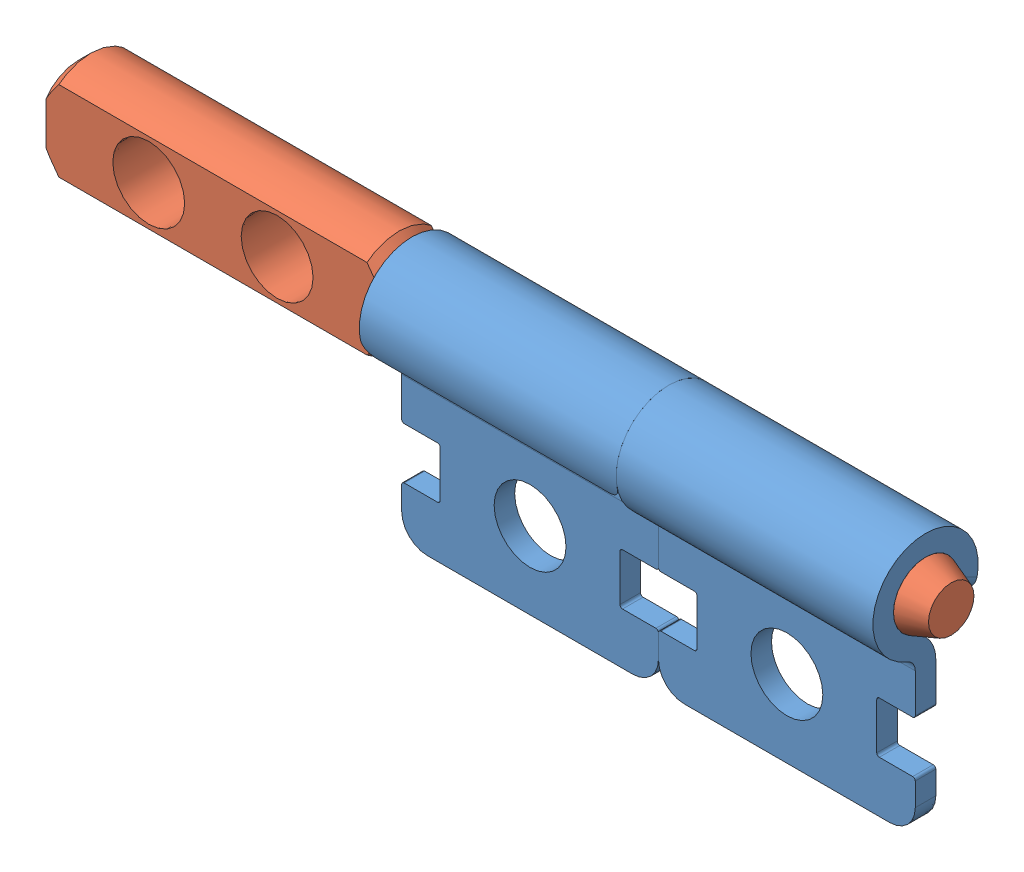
SolidWorks assembly ST060B0.SLDASM, configuration Default (file format 7000). Lengths in mm.
Overall size (34 10.05 4.1).
3 component instances, 2 part files, 6 mates.
Components (placement in the parent):
- ST030A Bracket-1: ST030A Bracket.SLDPRT [Default] at (1.2474 2.7652 10.0581) x (-1 0 0) z (0 0 -1) size (10.06 10.05 4.1)
- ST030A Bracket-2: ST030A Bracket.SLDPRT [Default] at (1.2474 2.7652 10.0581) size (10.06 10.05 4.1)
- ST060A Shaft-1: ST060A Shaft.SLDPRT [ST080B0] at (-21.7526 2.7652 10.0581) size (34 4 2.5)
Mates (geometry in assembly coordinates):
- Coincident1: coincident anti-aligned: plane of ST030A Bracket-1 through (1.2474 0.3793 9.1581) normal (1 0 0); plane of ST030A Bracket-2 through (1.2474 0.3793 10.9581) normal (-1 0 0)
- Concentric1: concentric anti-aligned: cylinder of ST030A Bracket-1 through (-8.7526 2.7652 10.0581) axis (1 0 0) radius 1.25; cylinder of ST030A Bracket-2 through (11.2474 2.7652 10.0581) axis (-1 0 0) radius 1.25
- Concentric2: concentric: cylinder of ST030A Bracket-1 through (-8.7526 2.7652 10.0581) axis (1 0 0) radius 1.25; cylinder of ST060A Shaft-1 through (-21.7526 2.7652 10.0581) axis (-1 0 0) radius 1.25
- Parallel1: parallel aligned: plane of ST030A Bracket-1 through (-8.7526 0.3793 10.4581) normal (0 0 1); plane of ST030A Bracket-2 through (11.2474 0.3793 10.4581) normal (0 0 1)
- Coincident3: coincident: plane of ST030A Bracket-1 through (-8.7526 0.3793 9.1581) normal (-1 0 0); plane of ST060A Shaft-1 through (-8.7526 4.2652 10.0581) normal (1 0 0)
- Parallel2: parallel aligned: plane of ST030A Bracket-1 through (-8.7526 0.3793 10.4581) normal (0 0 1); plane of ST060A Shaft-1 through (-2.7526 0.7652 11.3081) normal (0 0 1)
